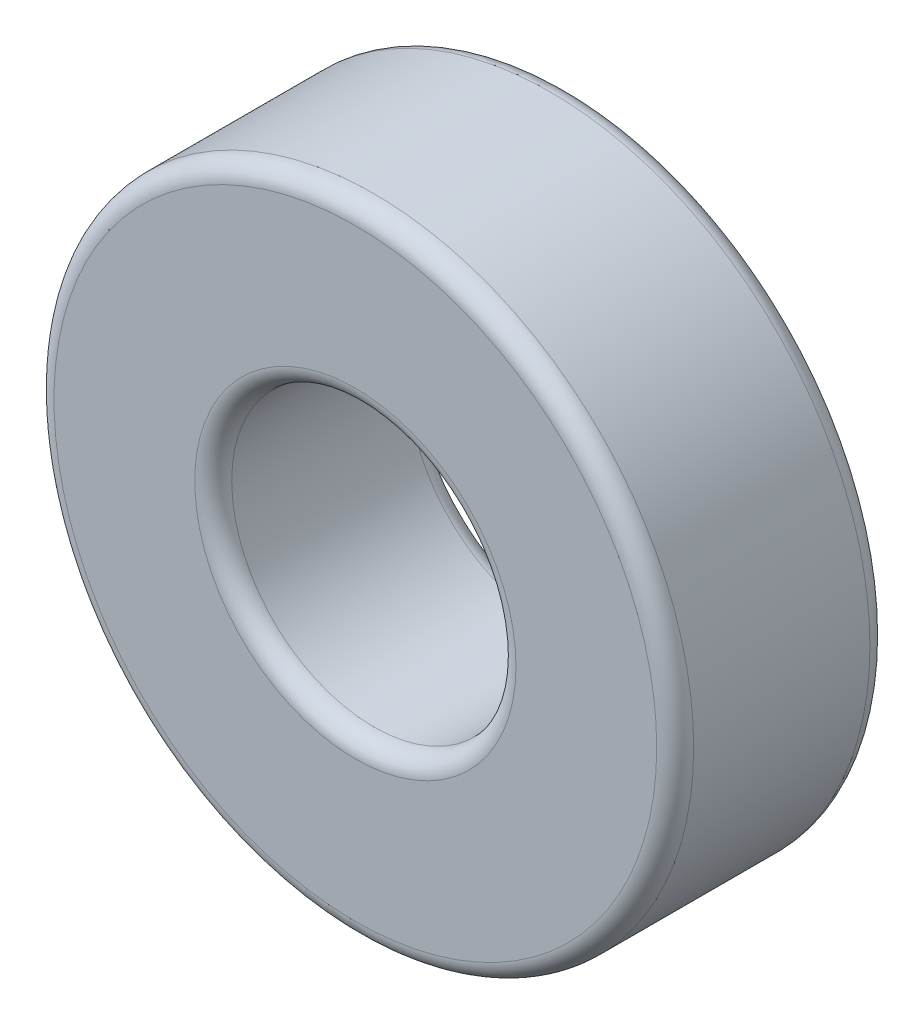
ISO-10303-21;
HEADER;
FILE_DESCRIPTION(('STEP AP214'),'2;1');
FILE_NAME('part.step','',(''),(''),'','','');
FILE_SCHEMA(('AUTOMOTIVE_DESIGN { 1 0 10303 214 1 1 1 1 }'));
ENDSEC;
DATA;
#1=APPLICATION_CONTEXT('core data for automotive mechanical design processes');
#2=APPLICATION_PROTOCOL_DEFINITION('international standard','automotive_design',2000,#1);
#3=PRODUCT_CONTEXT('',#1,'mechanical');
#4=PRODUCT('Part','Part','',(#3));
#5=PRODUCT_RELATED_PRODUCT_CATEGORY('part','',(#4));
#6=PRODUCT_DEFINITION_FORMATION('','',#4);
#7=PRODUCT_DEFINITION_CONTEXT('part definition',#1,'design');
#8=PRODUCT_DEFINITION('design','',#6,#7);
#9=PRODUCT_DEFINITION_SHAPE('','',#8);
#10=(LENGTH_UNIT() NAMED_UNIT(*) SI_UNIT(.MILLI.,.METRE.));
#11=(NAMED_UNIT(*) PLANE_ANGLE_UNIT() SI_UNIT($,.RADIAN.));
#12=(NAMED_UNIT(*) SI_UNIT($,.STERADIAN.) SOLID_ANGLE_UNIT());
#13=UNCERTAINTY_MEASURE_WITH_UNIT(LENGTH_MEASURE(1.E-05),#10,'distance_accuracy_value','');
#14=(GEOMETRIC_REPRESENTATION_CONTEXT(3) GLOBAL_UNCERTAINTY_ASSIGNED_CONTEXT((#13)) GLOBAL_UNIT_ASSIGNED_CONTEXT((#10,
#11,#12)) REPRESENTATION_CONTEXT('',''));
#15=CARTESIAN_POINT('',(0.,0.,0.));
#16=DIRECTION('',(0.,0.,1.));
#17=DIRECTION('',(1.,0.,0.));
#18=AXIS2_PLACEMENT_3D('',#15,#16,#17);
#19=CARTESIAN_POINT('',(0.,0.,4.76250000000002));
#20=DIRECTION('',(0.,0.,1.));
#21=DIRECTION('',(1.,0.,0.));
#22=AXIS2_PLACEMENT_3D('',#19,#20,#21);
#23=PLANE('',#22);
#24=CARTESIAN_POINT('',(0.,0.,4.76250000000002));
#25=DIRECTION('',(0.,0.,1.));
#26=DIRECTION('',(1.,0.,0.));
#27=AXIS2_PLACEMENT_3D('',#24,#25,#26);
#28=CIRCLE('',#27,7.1755);
#29=CARTESIAN_POINT('',(7.1755,0.,4.76250000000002));
#30=VERTEX_POINT('',#29);
#31=EDGE_CURVE('E45',#30,#30,#28,.F.);
#32=ORIENTED_EDGE('',*,*,#31,.T.);
#33=EDGE_LOOP('',(#32));
#34=FACE_BOUND('',#33,.T.);
#35=CARTESIAN_POINT('',(0.,0.,4.76250000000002));
#36=DIRECTION('',(0.,0.,1.));
#37=DIRECTION('',(1.,0.,0.));
#38=AXIS2_PLACEMENT_3D('',#35,#36,#37);
#39=CIRCLE('',#38,13.462);
#40=CARTESIAN_POINT('',(13.462,0.,4.76250000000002));
#41=VERTEX_POINT('',#40);
#42=EDGE_CURVE('E49',#41,#41,#39,.T.);
#43=ORIENTED_EDGE('',*,*,#42,.T.);
#44=EDGE_LOOP('',(#43));
#45=FACE_BOUND('',#44,.T.);
#46=ADVANCED_FACE('F34',(#34,#45),#23,.T.);
#47=CARTESIAN_POINT('',(0.,0.,-4.76249999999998));
#48=DIRECTION('',(0.,0.,1.));
#49=DIRECTION('',(1.,0.,0.));
#50=AXIS2_PLACEMENT_3D('',#47,#48,#49);
#51=PLANE('',#50);
#52=CARTESIAN_POINT('',(0.,0.,-4.76249999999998));
#53=DIRECTION('',(0.,0.,1.));
#54=DIRECTION('',(1.,0.,0.));
#55=AXIS2_PLACEMENT_3D('',#52,#53,#54);
#56=CIRCLE('',#55,7.1755);
#57=CARTESIAN_POINT('',(7.17549999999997,0.,-4.76249999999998));
#58=VERTEX_POINT('',#57);
#59=EDGE_CURVE('E60',#58,#58,#56,.T.);
#60=ORIENTED_EDGE('',*,*,#59,.T.);
#61=EDGE_LOOP('',(#60));
#62=FACE_BOUND('',#61,.T.);
#63=CARTESIAN_POINT('',(0.,0.,-4.76249999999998));
#64=DIRECTION('',(0.,0.,1.));
#65=DIRECTION('',(1.,0.,0.));
#66=AXIS2_PLACEMENT_3D('',#63,#64,#65);
#67=CIRCLE('',#66,13.462);
#68=CARTESIAN_POINT('',(13.462,0.,-4.76249999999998));
#69=VERTEX_POINT('',#68);
#70=EDGE_CURVE('E63',#69,#69,#67,.F.);
#71=ORIENTED_EDGE('',*,*,#70,.T.);
#72=EDGE_LOOP('',(#71));
#73=FACE_BOUND('',#72,.T.);
#74=ADVANCED_FACE('F67',(#62,#73),#51,.F.);
#75=CARTESIAN_POINT('',(0.,0.,4.76250000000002));
#76=DIRECTION('',(0.,0.,-1.));
#77=DIRECTION('',(-1.,0.,0.));
#78=AXIS2_PLACEMENT_3D('',#75,#76,#77);
#79=CYLINDRICAL_SURFACE('',#78,14.2875);
#80=CARTESIAN_POINT('',(0.,0.,-3.93699999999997));
#81=DIRECTION('',(0.,0.,1.));
#82=DIRECTION('',(1.,0.,0.));
#83=AXIS2_PLACEMENT_3D('',#80,#81,#82);
#84=CIRCLE('',#83,14.2875);
#85=CARTESIAN_POINT('',(-14.2875,0.,-3.93699999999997));
#86=VERTEX_POINT('',#85);
#87=EDGE_CURVE('E10',#86,#86,#84,.T.);
#88=CARTESIAN_POINT('',(0.,0.,3.93700000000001));
#89=DIRECTION('',(0.,0.,1.));
#90=DIRECTION('',(1.,0.,0.));
#91=AXIS2_PLACEMENT_3D('',#88,#89,#90);
#92=CIRCLE('',#91,14.2875);
#93=CARTESIAN_POINT('',(-14.2875,0.,3.93700000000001));
#94=VERTEX_POINT('',#93);
#95=EDGE_CURVE('E41',#94,#94,#92,.F.);
#96=CARTESIAN_POINT('',(-14.2875,0.,-3.93699999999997));
#97=CARTESIAN_POINT('',(-14.2875,0.,-3.85497916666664));
#98=CARTESIAN_POINT('',(-14.2875,0.,-3.7729583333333));
#99=CARTESIAN_POINT('',(-14.2875,0.,-3.60891666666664));
#100=CARTESIAN_POINT('',(-14.2875,0.,-3.5268958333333));
#101=CARTESIAN_POINT('',(-14.2875,0.,-3.36285416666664));
#102=CARTESIAN_POINT('',(-14.2875,0.,-3.28083333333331));
#103=CARTESIAN_POINT('',(-14.2875,0.,-3.11679166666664));
#104=CARTESIAN_POINT('',(-14.2875,0.,-3.03477083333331));
#105=CARTESIAN_POINT('',(-14.2875,0.,-2.87072916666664));
#106=CARTESIAN_POINT('',(-14.2875,0.,-2.78870833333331));
#107=CARTESIAN_POINT('',(-14.2875,0.,-2.62466666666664));
#108=CARTESIAN_POINT('',(-14.2875,0.,-2.54264583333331));
#109=CARTESIAN_POINT('',(-14.2875,0.,-2.37860416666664));
#110=CARTESIAN_POINT('',(-14.2875,0.,-2.29658333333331));
#111=CARTESIAN_POINT('',(-14.2875,0.,-2.13254166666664));
#112=CARTESIAN_POINT('',(-14.2875,0.,-2.05052083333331));
#113=CARTESIAN_POINT('',(-14.2875,0.,-1.88647916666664));
#114=CARTESIAN_POINT('',(-14.2875,0.,-1.80445833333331));
#115=CARTESIAN_POINT('',(-14.2875,0.,-1.64041666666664));
#116=CARTESIAN_POINT('',(-14.2875,0.,-1.55839583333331));
#117=CARTESIAN_POINT('',(-14.2875,0.,-1.39435416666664));
#118=CARTESIAN_POINT('',(-14.2875,0.,-1.31233333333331));
#119=CARTESIAN_POINT('',(-14.2875,0.,-1.14829166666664));
#120=CARTESIAN_POINT('',(-14.2875,0.,-1.06627083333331));
#121=CARTESIAN_POINT('',(-14.2875,0.,-0.902229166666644));
#122=CARTESIAN_POINT('',(-14.2875,0.,-0.820208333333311));
#123=CARTESIAN_POINT('',(-14.2875,0.,-0.656166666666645));
#124=CARTESIAN_POINT('',(-14.2875,0.,-0.574145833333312));
#125=CARTESIAN_POINT('',(-14.2875,0.,-0.410104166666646));
#126=CARTESIAN_POINT('',(-14.2875,0.,-0.328083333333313));
#127=CARTESIAN_POINT('',(-14.2875,0.,-0.164041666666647));
#128=CARTESIAN_POINT('',(-14.2875,0.,-0.0820208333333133));
#129=CARTESIAN_POINT('',(-14.2875,0.,0.0820208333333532));
#130=CARTESIAN_POINT('',(-14.2875,0.,0.164041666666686));
#131=CARTESIAN_POINT('',(-14.2875,0.,0.328083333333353));
#132=CARTESIAN_POINT('',(-14.2875,0.,0.410104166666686));
#133=CARTESIAN_POINT('',(-14.2875,0.,0.574145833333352));
#134=CARTESIAN_POINT('',(-14.2875,0.,0.656166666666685));
#135=CARTESIAN_POINT('',(-14.2875,0.,0.820208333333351));
#136=CARTESIAN_POINT('',(-14.2875,0.,0.902229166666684));
#137=CARTESIAN_POINT('',(-14.2875,0.,1.06627083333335));
#138=CARTESIAN_POINT('',(-14.2875,0.,1.14829166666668));
#139=CARTESIAN_POINT('',(-14.2875,0.,1.31233333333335));
#140=CARTESIAN_POINT('',(-14.2875,0.,1.39435416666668));
#141=CARTESIAN_POINT('',(-14.2875,0.,1.55839583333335));
#142=CARTESIAN_POINT('',(-14.2875,0.,1.64041666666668));
#143=CARTESIAN_POINT('',(-14.2875,0.,1.80445833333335));
#144=CARTESIAN_POINT('',(-14.2875,0.,1.88647916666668));
#145=CARTESIAN_POINT('',(-14.2875,0.,2.05052083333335));
#146=CARTESIAN_POINT('',(-14.2875,0.,2.13254166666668));
#147=CARTESIAN_POINT('',(-14.2875,0.,2.29658333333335));
#148=CARTESIAN_POINT('',(-14.2875,0.,2.37860416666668));
#149=CARTESIAN_POINT('',(-14.2875,0.,2.54264583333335));
#150=CARTESIAN_POINT('',(-14.2875,0.,2.62466666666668));
#151=CARTESIAN_POINT('',(-14.2875,0.,2.78870833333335));
#152=CARTESIAN_POINT('',(-14.2875,0.,2.87072916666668));
#153=CARTESIAN_POINT('',(-14.2875,0.,3.03477083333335));
#154=CARTESIAN_POINT('',(-14.2875,0.,3.11679166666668));
#155=CARTESIAN_POINT('',(-14.2875,0.,3.28083333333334));
#156=CARTESIAN_POINT('',(-14.2875,0.,3.36285416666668));
#157=CARTESIAN_POINT('',(-14.2875,0.,3.52689583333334));
#158=CARTESIAN_POINT('',(-14.2875,0.,3.60891666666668));
#159=CARTESIAN_POINT('',(-14.2875,0.,3.77295833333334));
#160=CARTESIAN_POINT('',(-14.2875,0.,3.85497916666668));
#161=CARTESIAN_POINT('',(-14.2875,0.,3.93700000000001));
#162=B_SPLINE_CURVE_WITH_KNOTS('',3,(#96,#97,#98,#99,#100,#101,#102,#103,#104,#105,#106,#107,
#108,#109,#110,#111,#112,#113,#114,#115,#116,#117,#118,#119,#120,#121,#122,#123,#124,#125,#126,
#127,#128,#129,#130,#131,#132,#133,#134,#135,#136,#137,#138,#139,#140,#141,#142,#143,#144,#145,
#146,#147,#148,#149,#150,#151,#152,#153,#154,#155,#156,#157,#158,#159,#160,#161),.UNSPECIFIED.,
.F.,.F.,(4,2,2,2,2,2,2,2,2,2,2,2,2,2,2,2,2,2,2,2,2,2,2,2,2,2,2,2,2,2,2,2,4),(0.,0.2460625,
0.492124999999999,0.738187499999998,0.984249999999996,1.2303125,1.476375,1.7224375,
1.96849999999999,2.21456249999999,2.46062499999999,2.70668749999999,2.95274999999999,
3.19881249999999,3.44487499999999,3.69093749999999,3.93699999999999,4.18306249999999,
4.42912499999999,4.67518749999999,4.92124999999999,5.16731249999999,5.41337499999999,
5.65943749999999,5.90549999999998,6.15156249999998,6.39762499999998,6.64368749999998,
6.88974999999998,7.13581249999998,7.38187499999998,7.62793749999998,7.87399999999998),.UNSPECIFIED.);
#163=EDGE_CURVE('BSEAM36',#86,#94,#162,.T.);
#164=ORIENTED_EDGE('',*,*,#87,.T.);
#165=ORIENTED_EDGE('',*,*,#95,.T.);
#166=ORIENTED_EDGE('',*,*,#163,.T.);
#167=ORIENTED_EDGE('',*,*,#163,.F.);
#168=EDGE_LOOP('',(#164,#166,#165,#167));
#169=FACE_BOUND('',#168,.T.);
#170=ADVANCED_FACE('F36',(#169),#79,.T.);
#171=CARTESIAN_POINT('',(0.,0.,4.76250000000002));
#172=DIRECTION('',(0.,0.,-1.));
#173=DIRECTION('',(-1.,0.,0.));
#174=AXIS2_PLACEMENT_3D('',#171,#172,#173);
#175=CYLINDRICAL_SURFACE('',#174,6.35);
#176=CARTESIAN_POINT('',(0.,0.,-3.93699999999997));
#177=DIRECTION('',(0.,0.,1.));
#178=DIRECTION('',(1.,0.,0.));
#179=AXIS2_PLACEMENT_3D('',#176,#177,#178);
#180=CIRCLE('',#179,6.35);
#181=CARTESIAN_POINT('',(-6.35,0.,-3.93699999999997));
#182=VERTEX_POINT('',#181);
#183=EDGE_CURVE('E54',#182,#182,#180,.F.);
#184=CARTESIAN_POINT('',(0.,0.,3.93700000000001));
#185=DIRECTION('',(0.,0.,1.));
#186=DIRECTION('',(1.,0.,0.));
#187=AXIS2_PLACEMENT_3D('',#184,#185,#186);
#188=CIRCLE('',#187,6.35);
#189=CARTESIAN_POINT('',(-6.35,0.,3.93700000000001));
#190=VERTEX_POINT('',#189);
#191=EDGE_CURVE('E57',#190,#190,#188,.T.);
#192=CARTESIAN_POINT('',(-6.35,0.,-3.93699999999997));
#193=CARTESIAN_POINT('',(-6.35,0.,-3.85497916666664));
#194=CARTESIAN_POINT('',(-6.35,0.,-3.7729583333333));
#195=CARTESIAN_POINT('',(-6.35,0.,-3.60891666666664));
#196=CARTESIAN_POINT('',(-6.35,0.,-3.5268958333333));
#197=CARTESIAN_POINT('',(-6.35,0.,-3.36285416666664));
#198=CARTESIAN_POINT('',(-6.35,0.,-3.28083333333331));
#199=CARTESIAN_POINT('',(-6.35,0.,-3.11679166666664));
#200=CARTESIAN_POINT('',(-6.35,0.,-3.03477083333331));
#201=CARTESIAN_POINT('',(-6.35,0.,-2.87072916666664));
#202=CARTESIAN_POINT('',(-6.35,0.,-2.78870833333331));
#203=CARTESIAN_POINT('',(-6.35,0.,-2.62466666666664));
#204=CARTESIAN_POINT('',(-6.35,0.,-2.54264583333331));
#205=CARTESIAN_POINT('',(-6.35,0.,-2.37860416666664));
#206=CARTESIAN_POINT('',(-6.35,0.,-2.29658333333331));
#207=CARTESIAN_POINT('',(-6.35,0.,-2.13254166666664));
#208=CARTESIAN_POINT('',(-6.35,0.,-2.05052083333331));
#209=CARTESIAN_POINT('',(-6.35,0.,-1.88647916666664));
#210=CARTESIAN_POINT('',(-6.35,0.,-1.80445833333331));
#211=CARTESIAN_POINT('',(-6.35,0.,-1.64041666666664));
#212=CARTESIAN_POINT('',(-6.35,0.,-1.55839583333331));
#213=CARTESIAN_POINT('',(-6.35,0.,-1.39435416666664));
#214=CARTESIAN_POINT('',(-6.35,0.,-1.31233333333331));
#215=CARTESIAN_POINT('',(-6.35,0.,-1.14829166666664));
#216=CARTESIAN_POINT('',(-6.35,0.,-1.06627083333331));
#217=CARTESIAN_POINT('',(-6.35,0.,-0.902229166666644));
#218=CARTESIAN_POINT('',(-6.35,0.,-0.820208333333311));
#219=CARTESIAN_POINT('',(-6.35,0.,-0.656166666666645));
#220=CARTESIAN_POINT('',(-6.35,0.,-0.574145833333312));
#221=CARTESIAN_POINT('',(-6.35,0.,-0.410104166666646));
#222=CARTESIAN_POINT('',(-6.35,0.,-0.328083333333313));
#223=CARTESIAN_POINT('',(-6.35,0.,-0.164041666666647));
#224=CARTESIAN_POINT('',(-6.35,0.,-0.0820208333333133));
#225=CARTESIAN_POINT('',(-6.35,0.,0.0820208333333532));
#226=CARTESIAN_POINT('',(-6.35,0.,0.164041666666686));
#227=CARTESIAN_POINT('',(-6.35,0.,0.328083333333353));
#228=CARTESIAN_POINT('',(-6.35,0.,0.410104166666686));
#229=CARTESIAN_POINT('',(-6.35,0.,0.574145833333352));
#230=CARTESIAN_POINT('',(-6.35,0.,0.656166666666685));
#231=CARTESIAN_POINT('',(-6.35,0.,0.820208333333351));
#232=CARTESIAN_POINT('',(-6.35,0.,0.902229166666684));
#233=CARTESIAN_POINT('',(-6.35,0.,1.06627083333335));
#234=CARTESIAN_POINT('',(-6.35,0.,1.14829166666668));
#235=CARTESIAN_POINT('',(-6.35,0.,1.31233333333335));
#236=CARTESIAN_POINT('',(-6.35,0.,1.39435416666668));
#237=CARTESIAN_POINT('',(-6.35,0.,1.55839583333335));
#238=CARTESIAN_POINT('',(-6.35,0.,1.64041666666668));
#239=CARTESIAN_POINT('',(-6.35,0.,1.80445833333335));
#240=CARTESIAN_POINT('',(-6.35,0.,1.88647916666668));
#241=CARTESIAN_POINT('',(-6.35,0.,2.05052083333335));
#242=CARTESIAN_POINT('',(-6.35,0.,2.13254166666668));
#243=CARTESIAN_POINT('',(-6.35,0.,2.29658333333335));
#244=CARTESIAN_POINT('',(-6.35,0.,2.37860416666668));
#245=CARTESIAN_POINT('',(-6.35,0.,2.54264583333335));
#246=CARTESIAN_POINT('',(-6.35,0.,2.62466666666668));
#247=CARTESIAN_POINT('',(-6.35,0.,2.78870833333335));
#248=CARTESIAN_POINT('',(-6.35,0.,2.87072916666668));
#249=CARTESIAN_POINT('',(-6.35,0.,3.03477083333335));
#250=CARTESIAN_POINT('',(-6.35,0.,3.11679166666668));
#251=CARTESIAN_POINT('',(-6.35,0.,3.28083333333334));
#252=CARTESIAN_POINT('',(-6.35,0.,3.36285416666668));
#253=CARTESIAN_POINT('',(-6.35,0.,3.52689583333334));
#254=CARTESIAN_POINT('',(-6.35,0.,3.60891666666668));
#255=CARTESIAN_POINT('',(-6.35,0.,3.77295833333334));
#256=CARTESIAN_POINT('',(-6.35,0.,3.85497916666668));
#257=CARTESIAN_POINT('',(-6.35,0.,3.93700000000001));
#258=B_SPLINE_CURVE_WITH_KNOTS('',3,(#192,#193,#194,#195,#196,#197,#198,#199,#200,#201,#202,
#203,#204,#205,#206,#207,#208,#209,#210,#211,#212,#213,#214,#215,#216,#217,#218,#219,#220,#221,
#222,#223,#224,#225,#226,#227,#228,#229,#230,#231,#232,#233,#234,#235,#236,#237,#238,#239,#240,
#241,#242,#243,#244,#245,#246,#247,#248,#249,#250,#251,#252,#253,#254,#255,#256,#257),
.UNSPECIFIED.,.F.,.F.,(4,2,2,2,2,2,2,2,2,2,2,2,2,2,2,2,2,2,2,2,2,2,2,2,2,2,2,2,2,2,2,2,4),(0.,
0.2460625,0.492124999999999,0.738187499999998,0.984249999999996,1.2303125,1.476375,1.7224375,
1.96849999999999,2.21456249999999,2.46062499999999,2.70668749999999,2.95274999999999,
3.19881249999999,3.44487499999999,3.69093749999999,3.93699999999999,4.18306249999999,
4.42912499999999,4.67518749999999,4.92124999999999,5.16731249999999,5.41337499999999,
5.65943749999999,5.90549999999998,6.15156249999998,6.39762499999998,6.64368749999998,
6.88974999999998,7.13581249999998,7.38187499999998,7.62793749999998,7.87399999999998),.UNSPECIFIED.);
#259=EDGE_CURVE('BSEAM93',#182,#190,#258,.T.);
#260=ORIENTED_EDGE('',*,*,#183,.T.);
#261=ORIENTED_EDGE('',*,*,#191,.T.);
#262=ORIENTED_EDGE('',*,*,#259,.T.);
#263=ORIENTED_EDGE('',*,*,#259,.F.);
#264=EDGE_LOOP('',(#260,#262,#261,#263));
#265=FACE_BOUND('',#264,.T.);
#266=ADVANCED_FACE('F93',(#265),#175,.F.);
#267=CARTESIAN_POINT('',(0.,0.,-3.93699999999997));
#268=DIRECTION('',(0.,0.,1.));
#269=DIRECTION('',(1.,0.,0.));
#270=AXIS2_PLACEMENT_3D('',#267,#268,#269);
#271=TOROIDAL_SURFACE('',#270,7.1755,0.8255);
#272=ORIENTED_EDGE('',*,*,#183,.F.);
#273=EDGE_LOOP('',(#272));
#274=FACE_BOUND('',#273,.T.);
#275=ORIENTED_EDGE('',*,*,#59,.F.);
#276=EDGE_LOOP('',(#275));
#277=FACE_BOUND('',#276,.T.);
#278=ADVANCED_FACE('F81',(#274,#277),#271,.T.);
#279=CARTESIAN_POINT('',(0.,0.,3.93700000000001));
#280=DIRECTION('',(0.,0.,1.));
#281=DIRECTION('',(1.,0.,0.));
#282=AXIS2_PLACEMENT_3D('',#279,#280,#281);
#283=TOROIDAL_SURFACE('',#282,7.1755,0.8255);
#284=ORIENTED_EDGE('',*,*,#31,.F.);
#285=EDGE_LOOP('',(#284));
#286=FACE_BOUND('',#285,.T.);
#287=ORIENTED_EDGE('',*,*,#191,.F.);
#288=EDGE_LOOP('',(#287));
#289=FACE_BOUND('',#288,.T.);
#290=ADVANCED_FACE('F73',(#286,#289),#283,.T.);
#291=CARTESIAN_POINT('',(0.,0.,-3.93699999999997));
#292=DIRECTION('',(0.,0.,1.));
#293=DIRECTION('',(1.,0.,0.));
#294=AXIS2_PLACEMENT_3D('',#291,#292,#293);
#295=TOROIDAL_SURFACE('',#294,13.462,0.8255);
#296=ORIENTED_EDGE('',*,*,#70,.F.);
#297=EDGE_LOOP('',(#296));
#298=FACE_BOUND('',#297,.T.);
#299=ORIENTED_EDGE('',*,*,#87,.F.);
#300=EDGE_LOOP('',(#299));
#301=FACE_BOUND('',#300,.T.);
#302=ADVANCED_FACE('F69',(#298,#301),#295,.T.);
#303=CARTESIAN_POINT('',(0.,0.,3.93700000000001));
#304=DIRECTION('',(0.,0.,1.));
#305=DIRECTION('',(1.,0.,0.));
#306=AXIS2_PLACEMENT_3D('',#303,#304,#305);
#307=TOROIDAL_SURFACE('',#306,13.462,0.8255);
#308=ORIENTED_EDGE('',*,*,#95,.F.);
#309=EDGE_LOOP('',(#308));
#310=FACE_BOUND('',#309,.T.);
#311=ORIENTED_EDGE('',*,*,#42,.F.);
#312=EDGE_LOOP('',(#311));
#313=FACE_BOUND('',#312,.T.);
#314=ADVANCED_FACE('F72',(#310,#313),#307,.T.);
#315=CLOSED_SHELL('',(#46,#74,#170,#266,#278,#290,#302,#314));
#316=MANIFOLD_SOLID_BREP('B2',#315);
#317=ADVANCED_BREP_SHAPE_REPRESENTATION('',(#18,#316),#14);
#318=SHAPE_DEFINITION_REPRESENTATION(#9,#317);
ENDSEC;
END-ISO-10303-21;
